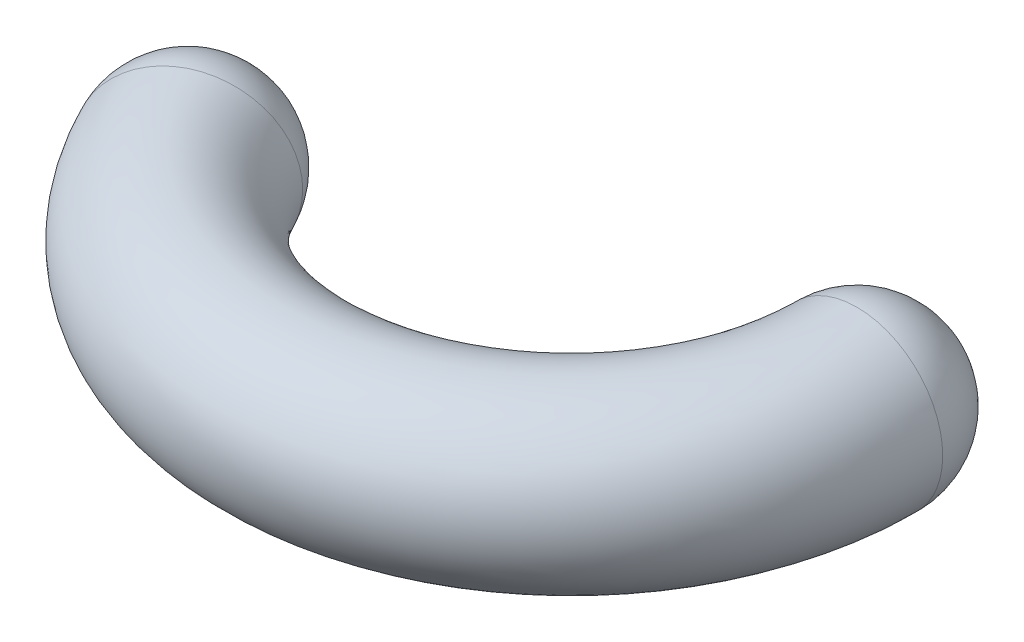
ISO-10303-21;
HEADER;
FILE_DESCRIPTION(('STEP AP214'),'2;1');
FILE_NAME('part.step','',(''),(''),'','','');
FILE_SCHEMA(('AUTOMOTIVE_DESIGN { 1 0 10303 214 1 1 1 1 }'));
ENDSEC;
DATA;
#1=APPLICATION_CONTEXT('core data for automotive mechanical design processes');
#2=APPLICATION_PROTOCOL_DEFINITION('international standard','automotive_design',2000,#1);
#3=PRODUCT_CONTEXT('',#1,'mechanical');
#4=PRODUCT('Part','Part','',(#3));
#5=PRODUCT_RELATED_PRODUCT_CATEGORY('part','',(#4));
#6=PRODUCT_DEFINITION_FORMATION('','',#4);
#7=PRODUCT_DEFINITION_CONTEXT('part definition',#1,'design');
#8=PRODUCT_DEFINITION('design','',#6,#7);
#9=PRODUCT_DEFINITION_SHAPE('','',#8);
#10=(LENGTH_UNIT() NAMED_UNIT(*) SI_UNIT(.MILLI.,.METRE.));
#11=(NAMED_UNIT(*) PLANE_ANGLE_UNIT() SI_UNIT($,.RADIAN.));
#12=(NAMED_UNIT(*) SI_UNIT($,.STERADIAN.) SOLID_ANGLE_UNIT());
#13=UNCERTAINTY_MEASURE_WITH_UNIT(LENGTH_MEASURE(1.E-05),#10,'distance_accuracy_value','');
#14=(GEOMETRIC_REPRESENTATION_CONTEXT(3) GLOBAL_UNCERTAINTY_ASSIGNED_CONTEXT((#13)) GLOBAL_UNIT_ASSIGNED_CONTEXT((#10,
#11,#12)) REPRESENTATION_CONTEXT('',''));
#15=CARTESIAN_POINT('',(0.,0.,0.));
#16=DIRECTION('',(0.,0.,1.));
#17=DIRECTION('',(1.,0.,0.));
#18=AXIS2_PLACEMENT_3D('',#15,#16,#17);
#19=CARTESIAN_POINT('',(52.5,115.58,0.));
#20=DIRECTION('',(0.,1.,0.));
#21=DIRECTION('',(0.,0.,1.));
#22=AXIS2_PLACEMENT_3D('',#19,#20,#21);
#23=TOROIDAL_SURFACE('',#22,5.,1.5);
#24=CARTESIAN_POINT('',(57.5,115.58,0.));
#25=DIRECTION('',(0.,0.,1.));
#26=DIRECTION('',(-1.,0.,0.));
#27=AXIS2_PLACEMENT_3D('',#24,#25,#26);
#28=CIRCLE('',#27,1.5);
#29=CARTESIAN_POINT('',(57.5,117.08,0.));
#30=VERTEX_POINT('',#29);
#31=CARTESIAN_POINT('',(57.5,114.08,0.));
#32=VERTEX_POINT('',#31);
#33=EDGE_CURVE('E11',#30,#32,#28,.T.);
#34=ORIENTED_EDGE('',*,*,#33,.T.);
#35=CARTESIAN_POINT('',(57.5,115.58,0.));
#36=DIRECTION('',(0.,0.,-1.));
#37=DIRECTION('',(1.,0.,0.));
#38=AXIS2_PLACEMENT_3D('',#35,#36,#37);
#39=CIRCLE('',#38,1.5);
#40=EDGE_CURVE('E24',#30,#32,#39,.T.);
#41=ORIENTED_EDGE('',*,*,#40,.F.);
#42=EDGE_LOOP('',(#34,#41));
#43=FACE_BOUND('',#42,.T.);
#44=CARTESIAN_POINT('',(48.027864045,115.58,2.23606797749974));
#45=DIRECTION('',(-0.447213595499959,0.,-0.894427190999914));
#46=DIRECTION('',(0.89442719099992,0.,-0.447213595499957));
#47=AXIS2_PLACEMENT_3D('',#44,#45,#46);
#48=CIRCLE('',#47,1.5);
#49=CARTESIAN_POINT('',(48.0278640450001,117.08,2.23606797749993));
#50=VERTEX_POINT('',#49);
#51=CARTESIAN_POINT('',(48.027864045,114.08,2.23606797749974));
#52=VERTEX_POINT('',#51);
#53=EDGE_CURVE('E40',#50,#52,#48,.T.);
#54=ORIENTED_EDGE('',*,*,#53,.F.);
#55=CARTESIAN_POINT('',(48.027864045,115.58,2.23606797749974));
#56=DIRECTION('',(0.447213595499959,0.,0.894427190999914));
#57=DIRECTION('',(-0.89442719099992,0.,0.447213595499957));
#58=AXIS2_PLACEMENT_3D('',#55,#56,#57);
#59=CIRCLE('',#58,1.5);
#60=EDGE_CURVE('E30',#50,#52,#59,.T.);
#61=ORIENTED_EDGE('',*,*,#60,.T.);
#62=EDGE_LOOP('',(#54,#61));
#63=FACE_BOUND('',#62,.T.);
#64=ADVANCED_FACE('F16',(#43,#63),#23,.T.);
#65=CARTESIAN_POINT('',(57.5,115.58,0.));
#66=DIRECTION('',(0.,-1.,0.));
#67=DIRECTION('',(1.,0.,0.));
#68=AXIS2_PLACEMENT_3D('',#65,#66,#67);
#69=SPHERICAL_SURFACE('',#68,1.5);
#70=CARTESIAN_POINT('',(57.5,115.58,0.));
#71=DIRECTION('',(0.,0.,1.));
#72=DIRECTION('',(-1.,0.,0.));
#73=AXIS2_PLACEMENT_3D('',#70,#71,#72);
#74=SPHERICAL_SURFACE('',#73,1.5);
#75=ORIENTED_EDGE('',*,*,#33,.F.);
#76=ORIENTED_EDGE('',*,*,#40,.T.);
#77=EDGE_LOOP('',(#75,#76));
#78=FACE_BOUND('',#77,.T.);
#79=ADVANCED_FACE('F62',(#78),#74,.T.);
#80=CARTESIAN_POINT('',(48.027864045,115.58,2.23606797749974));
#81=DIRECTION('',(0.,-1.,0.));
#82=DIRECTION('',(0.89442719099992,0.,-0.447213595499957));
#83=AXIS2_PLACEMENT_3D('',#80,#81,#82);
#84=SPHERICAL_SURFACE('',#83,1.5);
#85=CARTESIAN_POINT('',(48.027864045,115.58,2.23606797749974));
#86=DIRECTION('',(0.44721359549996,0.,0.894427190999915));
#87=DIRECTION('',(-0.894427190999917,0.,0.447213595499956));
#88=AXIS2_PLACEMENT_3D('',#85,#86,#87);
#89=SPHERICAL_SURFACE('',#88,1.5);
#90=ORIENTED_EDGE('',*,*,#60,.F.);
#91=ORIENTED_EDGE('',*,*,#53,.T.);
#92=EDGE_LOOP('',(#90,#91));
#93=FACE_BOUND('',#92,.T.);
#94=ADVANCED_FACE('F41',(#93),#89,.T.);
#95=CLOSED_SHELL('',(#64,#79,#94));
#96=MANIFOLD_SOLID_BREP('B1',#95);
#97=ADVANCED_BREP_SHAPE_REPRESENTATION('',(#18,#96),#14);
#98=SHAPE_DEFINITION_REPRESENTATION(#9,#97);
ENDSEC;
END-ISO-10303-21;
